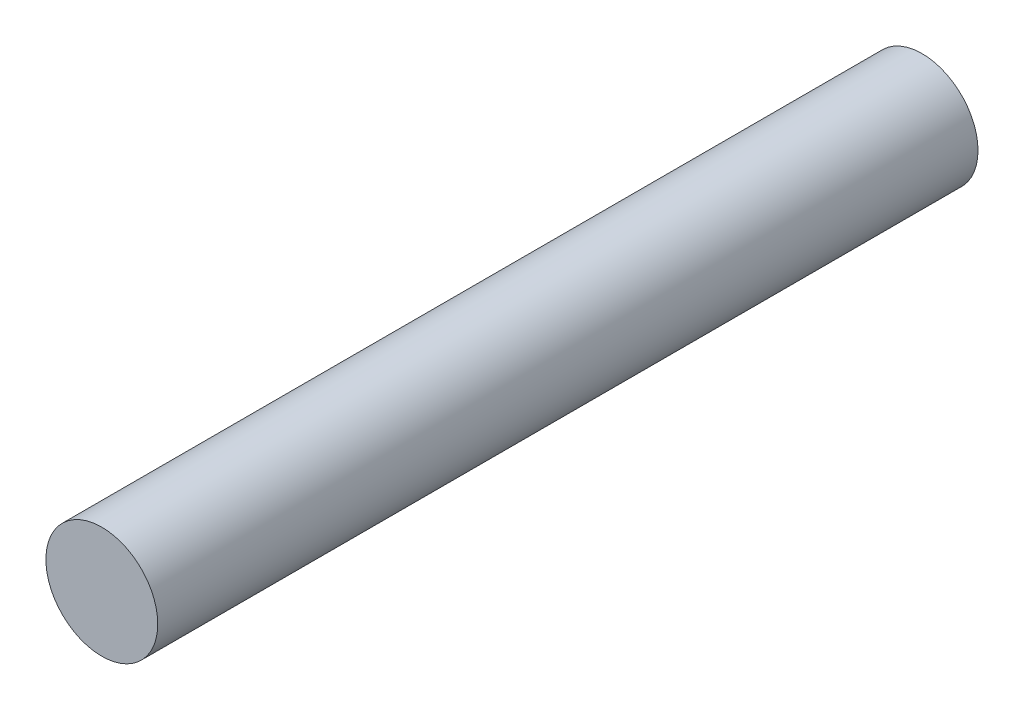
ISO-10303-21;
HEADER;
FILE_DESCRIPTION(('STEP AP214'),'2;1');
FILE_NAME('part.step','',(''),(''),'','','');
FILE_SCHEMA(('AUTOMOTIVE_DESIGN { 1 0 10303 214 1 1 1 1 }'));
ENDSEC;
DATA;
#1=APPLICATION_CONTEXT('core data for automotive mechanical design processes');
#2=APPLICATION_PROTOCOL_DEFINITION('international standard','automotive_design',2000,#1);
#3=PRODUCT_CONTEXT('',#1,'mechanical');
#4=PRODUCT('Part','Part','',(#3));
#5=PRODUCT_RELATED_PRODUCT_CATEGORY('part','',(#4));
#6=PRODUCT_DEFINITION_FORMATION('','',#4);
#7=PRODUCT_DEFINITION_CONTEXT('part definition',#1,'design');
#8=PRODUCT_DEFINITION('design','',#6,#7);
#9=PRODUCT_DEFINITION_SHAPE('','',#8);
#10=(LENGTH_UNIT() NAMED_UNIT(*) SI_UNIT(.MILLI.,.METRE.));
#11=(NAMED_UNIT(*) PLANE_ANGLE_UNIT() SI_UNIT($,.RADIAN.));
#12=(NAMED_UNIT(*) SI_UNIT($,.STERADIAN.) SOLID_ANGLE_UNIT());
#13=UNCERTAINTY_MEASURE_WITH_UNIT(LENGTH_MEASURE(1.E-05),#10,'distance_accuracy_value','');
#14=(GEOMETRIC_REPRESENTATION_CONTEXT(3) GLOBAL_UNCERTAINTY_ASSIGNED_CONTEXT((#13)) GLOBAL_UNIT_ASSIGNED_CONTEXT((#10,
#11,#12)) REPRESENTATION_CONTEXT('',''));
#15=CARTESIAN_POINT('',(0.,0.,0.));
#16=DIRECTION('',(0.,0.,1.));
#17=DIRECTION('',(1.,0.,0.));
#18=AXIS2_PLACEMENT_3D('',#15,#16,#17);
#19=CARTESIAN_POINT('',(0.,0.,110.));
#20=DIRECTION('',(0.,0.,-1.));
#21=DIRECTION('',(-1.,0.,0.));
#22=AXIS2_PLACEMENT_3D('',#19,#20,#21);
#23=CYLINDRICAL_SURFACE('',#22,7.5);
#24=CARTESIAN_POINT('',(0.,0.,110.));
#25=DIRECTION('',(0.,0.,1.));
#26=DIRECTION('',(1.,0.,0.));
#27=AXIS2_PLACEMENT_3D('',#24,#25,#26);
#28=CIRCLE('',#27,7.5);
#29=CARTESIAN_POINT('',(7.5,0.,110.));
#30=VERTEX_POINT('',#29);
#31=EDGE_CURVE('E10',#30,#30,#28,.T.);
#32=ORIENTED_EDGE('',*,*,#31,.F.);
#33=EDGE_LOOP('',(#32));
#34=FACE_BOUND('',#33,.T.);
#35=CARTESIAN_POINT('',(0.,0.,0.));
#36=DIRECTION('',(0.,0.,1.));
#37=DIRECTION('',(1.,0.,0.));
#38=AXIS2_PLACEMENT_3D('',#35,#36,#37);
#39=CIRCLE('',#38,7.5);
#40=CARTESIAN_POINT('',(7.5,0.,0.));
#41=VERTEX_POINT('',#40);
#42=EDGE_CURVE('E34',#41,#41,#39,.T.);
#43=ORIENTED_EDGE('',*,*,#42,.T.);
#44=EDGE_LOOP('',(#43));
#45=FACE_BOUND('',#44,.T.);
#46=ADVANCED_FACE('F31',(#34,#45),#23,.T.);
#47=CARTESIAN_POINT('',(0.,0.,110.));
#48=DIRECTION('',(0.,0.,1.));
#49=DIRECTION('',(1.,0.,0.));
#50=AXIS2_PLACEMENT_3D('',#47,#48,#49);
#51=PLANE('',#50);
#52=ORIENTED_EDGE('',*,*,#31,.T.);
#53=EDGE_LOOP('',(#52));
#54=FACE_BOUND('',#53,.T.);
#55=ADVANCED_FACE('F46',(#54),#51,.T.);
#56=CARTESIAN_POINT('',(0.,0.,0.));
#57=DIRECTION('',(0.,0.,1.));
#58=DIRECTION('',(1.,0.,0.));
#59=AXIS2_PLACEMENT_3D('',#56,#57,#58);
#60=PLANE('',#59);
#61=ORIENTED_EDGE('',*,*,#42,.F.);
#62=EDGE_LOOP('',(#61));
#63=FACE_BOUND('',#62,.T.);
#64=ADVANCED_FACE('F44',(#63),#60,.F.);
#65=CLOSED_SHELL('',(#46,#55,#64));
#66=MANIFOLD_SOLID_BREP('B2',#65);
#67=ADVANCED_BREP_SHAPE_REPRESENTATION('',(#18,#66),#14);
#68=SHAPE_DEFINITION_REPRESENTATION(#9,#67);
ENDSEC;
END-ISO-10303-21;
